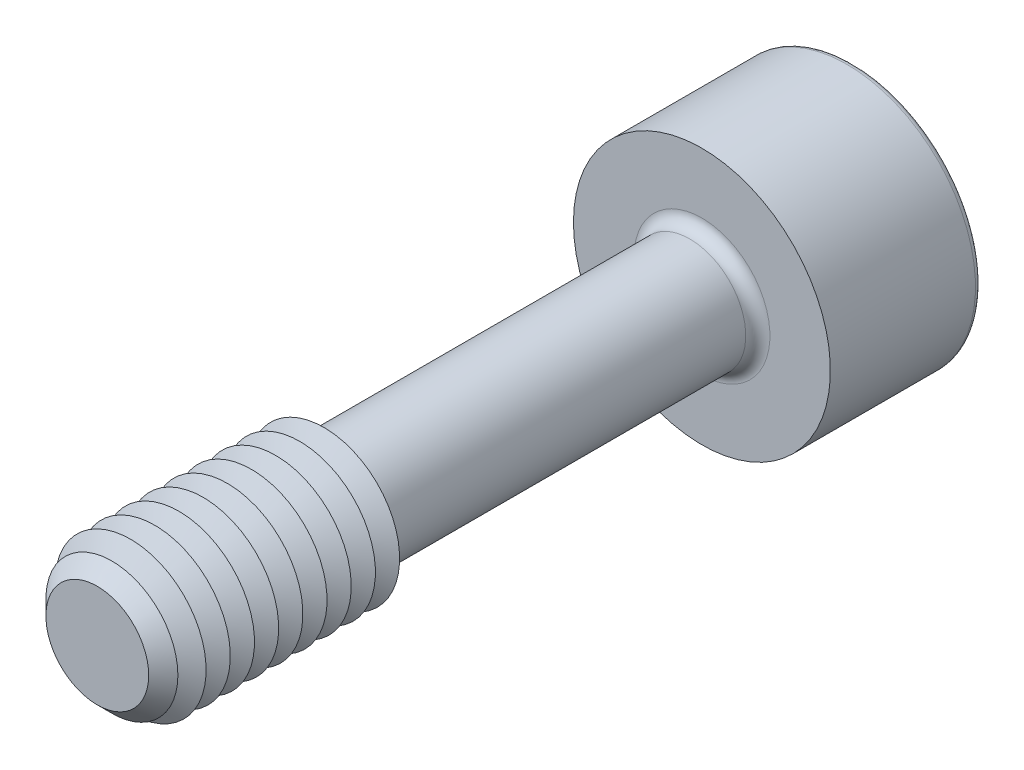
from build123d import *

# Parameters (mm, degrees)
SKETCH1_R       = 1.85
EXTRUDE1_DEPTH  = 10
CHAMFER1_SIZE   = 0.8
SKETCH3_R       = 4.25
EXTRUDE2_DEPTH  = 5
EXTRUDE3_DEPTH  = 4
FILLET1_R       = 0.4
FILLET2_R       = 0.2
LPATTERN1_COUNT = 9
LPATTERN1_PITCH = 0.8


with BuildPart() as part:
    # Sketch1 → Extrude1 (new, symmetric)
    with BuildSketch(Plane.XY):
        Circle(SKETCH1_R)
    extrude(amount=EXTRUDE1_DEPTH, both=True)

    # Sketch2 → Revolve1 (revolve)
    with BuildSketch(Plane(origin=(0, 0, 0), x_dir=(0, 0, -1), z_dir=(1, 0, 0))):
        Polygon((-10, 0), (-10, 2.5), (-2.5, 2.5), (-2.124722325, 1.85), (-2.124722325, 0), align=None)
    revolve(axis=Axis((0, 0, 2.124722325), (0, 0, 1)))

    # Chamfer1
    chamfer1_edges = [part.edges().sort_by_distance(p)[0] for p in [
        (0, -2.5, 10),
    ]]
    chamfer(chamfer1_edges, length=CHAMFER1_SIZE)

    # Sketch3 → Extrude2 (add)
    with BuildSketch(Plane(origin=(0, 0, -10), x_dir=(-1, 0, 0), z_dir=(0, 0, -1))):
        Circle(SKETCH3_R)
    extrude(amount=EXTRUDE2_DEPTH)

    # Sketch4 → Extrude3 (cut)
    with BuildSketch(Plane(origin=(-13.7, 0, -15), x_dir=(1, 0, 0), z_dir=(0, 0, 1))):
        Polygon((12.545299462, -2), (14.854700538, -2), (16.009401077, 0), (14.854700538, 2), (12.545299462, 2), (11.390598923, 0), align=None)
    extrude(amount=EXTRUDE3_DEPTH, mode=Mode.SUBTRACT)

    # Fillet1
    fillet1_edges = [part.edges().sort_by_distance(p)[0] for p in [
        (-1.85, 0, -10),
    ]]
    fillet(fillet1_edges, radius=FILLET1_R)

    # Fillet2
    fillet2_edges = [part.edges().sort_by_distance(p)[0] for p in [
        (4.25, 0, -15),
    ]]
    fillet(fillet2_edges, radius=FILLET2_R)

    # Sketch5 → Cut-Revolve1 (revolve, cut)
    with BuildSketch(Plane(origin=(0, 0, 0), x_dir=(0, 0, -1), z_dir=(1, 0, 0)), mode=Mode.PRIVATE) as cut_revolve1_sk:
        Polygon((11, 0), (11, -2), (9.845299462, 0), align=None)
    revolve(cut_revolve1_sk.sketch.rotate(Axis((0, 0, -9.845299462), (0, 0, -1)), 90), axis=Axis((0, 0, -9.845299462), (0, 0, -1)), mode=Mode.SUBTRACT)

    # Sketch7 → Cut-Revolve2 (revolve, cut)
    with BuildSketch(Plane(origin=(0, 0, 0), x_dir=(0, 0, -1), z_dir=(1, 0, 0)), mode=Mode.PRIVATE) as cut_revolve2_sk:
        Polygon((-2.5, 2.5), (-2.9, 1.807179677), (-3.3, 2.5), align=None)
    cut_revolve2 = revolve(cut_revolve2_sk.sketch.rotate(Axis((0, 0, -1.332048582), (0, 0, 1)), 90), axis=Axis((0, 0, -1.332048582), (0, 0, 1)), mode=Mode.SUBTRACT)

    # LPattern1: Cut-Revolve2 ×9
    with Locations(*[(0, 0, i * LPATTERN1_PITCH) for i in range(1, LPATTERN1_COUNT)]):
        add(cut_revolve2, mode=Mode.SUBTRACT)


solid = part.part
